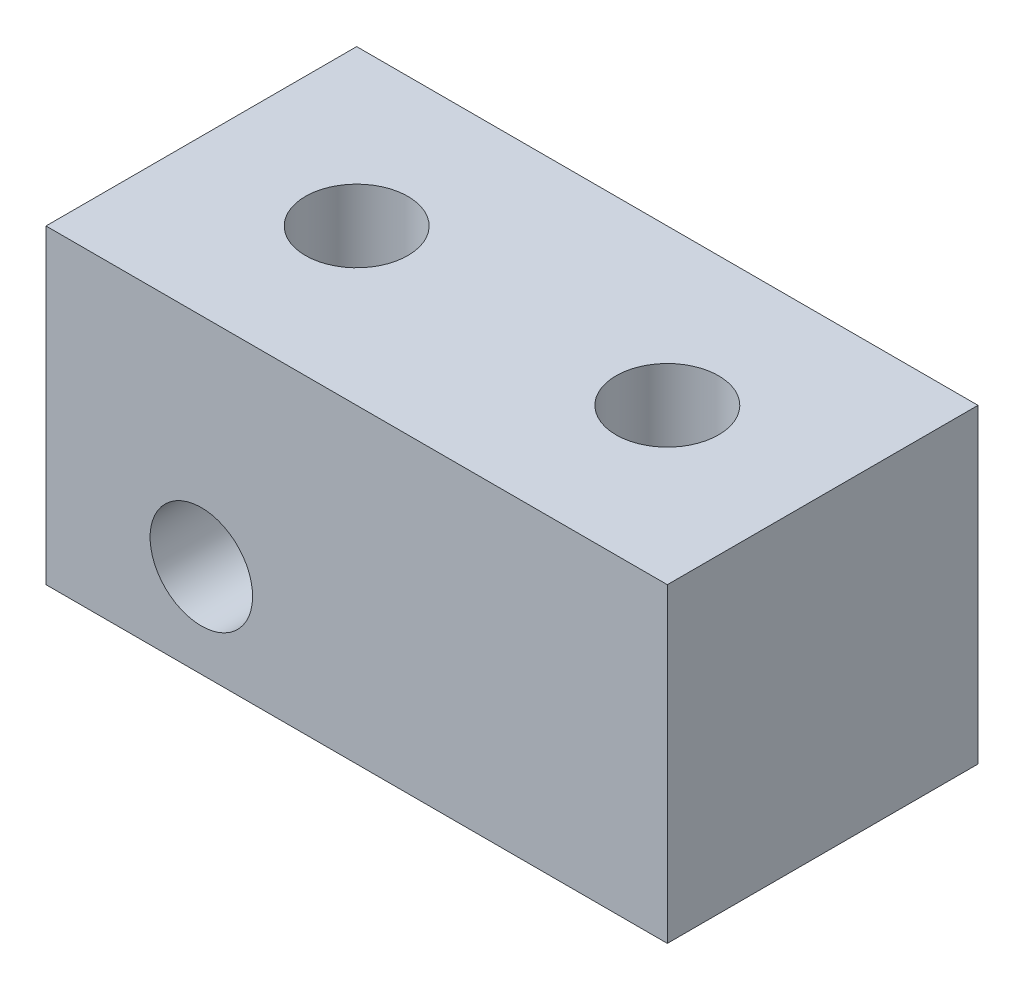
from build123d import *

# Parameters (mm, degrees)
SKETCH1_W                  = 20
SKETCH1_H                  = 10
BOSS_EXTRUDE1_DEPTH        = 10
M4_TAPPED_HOLE1_D          = 3.3
F_3_3_3_3_DIAMETER_HOLE1_D = 3.3


with BuildPart() as part:
    # Sketch1 → Boss-Extrude1 (new body)
    with BuildSketch(Plane.XY):
        with Locations((10, 5)):
            Rectangle(SKETCH1_W, SKETCH1_H)
    extrude(amount=BOSS_EXTRUDE1_DEPTH)

    # M4 Tapped Hole1 (through all)
    with Locations(Plane(origin=(5, 10, 5), x_dir=(0, 0, 1), z_dir=(0, 1, 0))):
        with Locations((0, 0), (0, 10)):
            Hole(M4_TAPPED_HOLE1_D / 2)

    # 3.3 _3.3_ Diameter Hole1 (through all)
    with Locations(Plane(origin=(5, 3, 10), x_dir=(1, 0, 0), z_dir=(0, 0, 1))):
        with Locations((0, 0)):
            Hole(F_3_3_3_3_DIAMETER_HOLE1_D / 2)


solid = part.part
